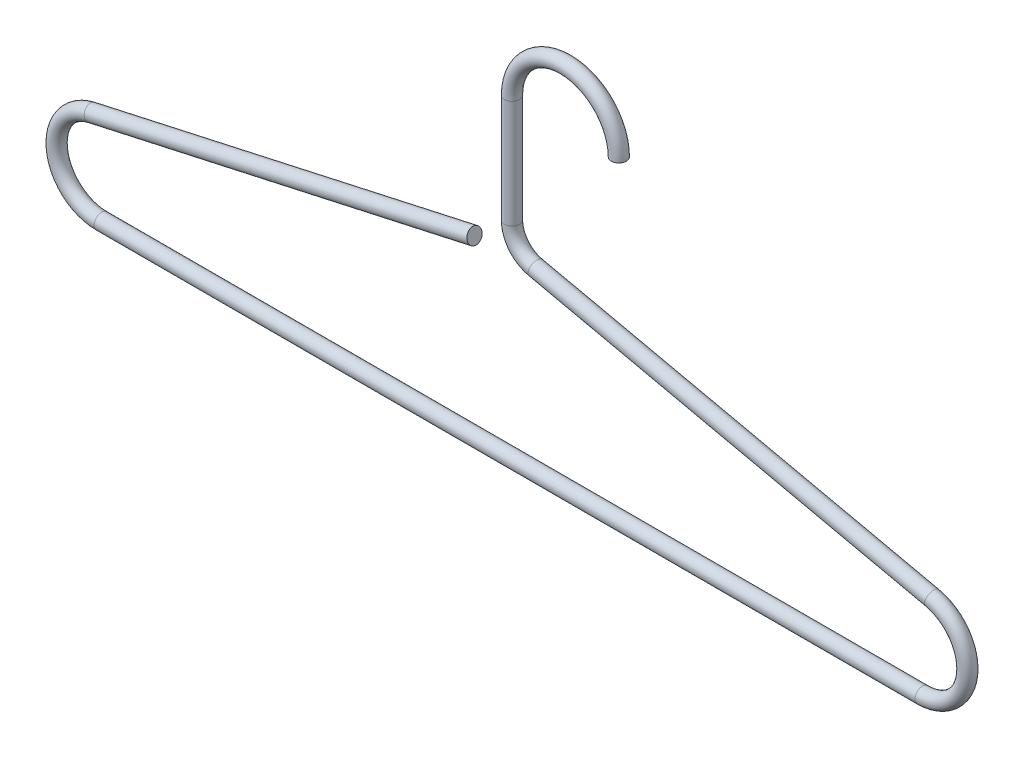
from build123d import *

# Parameters (mm, degrees)
SKETCH2_R = 3.175


with BuildPart() as part:
    # Sweep1: sweep along a path in Sketch1
    with BuildLine(Plane.XY) as sweep1_path:
        Line((-15.877829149, -4.311433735), (-177.807440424, -40.12850914))
        ThreePointArc((-177.807440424, -40.12850914), (-192.63050064, -60.79828413), (-173.693228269, -77.778932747))
        Line((-173.693228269, -77.778932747), (173.693228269, -77.778932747))
        ThreePointArc((173.693228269, -77.778932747), (192.63050064, -60.79828413), (177.807440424, -40.12850914))
        Line((177.807440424, -40.12850914), (9.957191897, -3.001852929))
        ThreePointArc((9.957191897, -3.001852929), (2.797382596, 1.446815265), (0, 9.398429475))
        Line((0, 9.398429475), (0, 55.109156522))
        ThreePointArc((0, 55.109156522), (22.608503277, 77.717659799), (45.217006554, 55.109156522))
    # Sketch2 → Sweep1 (sweep)
    with BuildSketch(Plane(origin=(-15.877829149, -4.311433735, 0), x_dir=(0, 0, -1), z_dir=(0.9764001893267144, 0.2159691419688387, 0))):
        Circle(SKETCH2_R)
    sweep(path=sweep1_path.line)


solid = part.part
